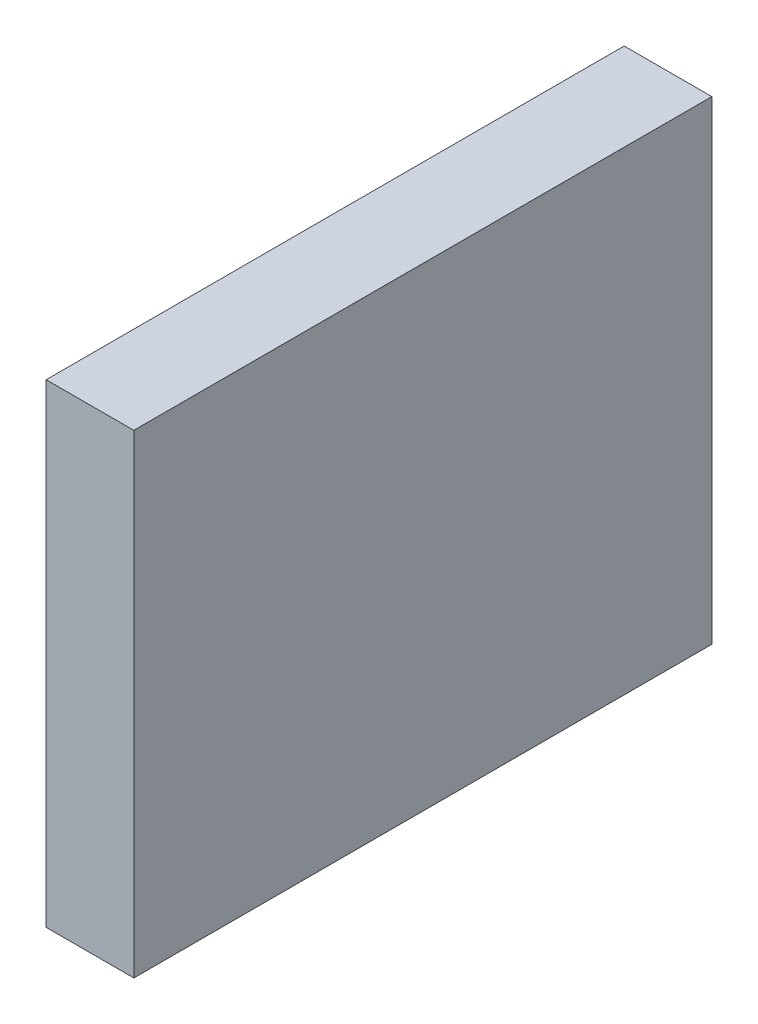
ISO-10303-21;
HEADER;
FILE_DESCRIPTION(('STEP AP214'),'2;1');
FILE_NAME('part.step','',(''),(''),'','','');
FILE_SCHEMA(('AUTOMOTIVE_DESIGN { 1 0 10303 214 1 1 1 1 }'));
ENDSEC;
DATA;
#1=APPLICATION_CONTEXT('core data for automotive mechanical design processes');
#2=APPLICATION_PROTOCOL_DEFINITION('international standard','automotive_design',2000,#1);
#3=PRODUCT_CONTEXT('',#1,'mechanical');
#4=PRODUCT('Part','Part','',(#3));
#5=PRODUCT_RELATED_PRODUCT_CATEGORY('part','',(#4));
#6=PRODUCT_DEFINITION_FORMATION('','',#4);
#7=PRODUCT_DEFINITION_CONTEXT('part definition',#1,'design');
#8=PRODUCT_DEFINITION('design','',#6,#7);
#9=PRODUCT_DEFINITION_SHAPE('','',#8);
#10=(LENGTH_UNIT() NAMED_UNIT(*) SI_UNIT(.MILLI.,.METRE.));
#11=(NAMED_UNIT(*) PLANE_ANGLE_UNIT() SI_UNIT($,.RADIAN.));
#12=(NAMED_UNIT(*) SI_UNIT($,.STERADIAN.) SOLID_ANGLE_UNIT());
#13=UNCERTAINTY_MEASURE_WITH_UNIT(LENGTH_MEASURE(1.E-05),#10,'distance_accuracy_value','');
#14=(GEOMETRIC_REPRESENTATION_CONTEXT(3) GLOBAL_UNCERTAINTY_ASSIGNED_CONTEXT((#13)) GLOBAL_UNIT_ASSIGNED_CONTEXT((#10,
#11,#12)) REPRESENTATION_CONTEXT('',''));
#15=CARTESIAN_POINT('',(0.,0.,0.));
#16=DIRECTION('',(0.,0.,1.));
#17=DIRECTION('',(1.,0.,0.));
#18=AXIS2_PLACEMENT_3D('',#15,#16,#17);
#19=CARTESIAN_POINT('',(0.,0.,102.));
#20=DIRECTION('',(1.,0.,0.));
#21=DIRECTION('',(0.,0.,-1.));
#22=AXIS2_PLACEMENT_3D('',#19,#20,#21);
#23=PLANE('',#22);
#24=DIRECTION('',(0.,-1.,0.));
#25=VECTOR('',#24,1.);
#26=CARTESIAN_POINT('',(0.,0.,0.));
#27=LINE('',#26,#25);
#28=CARTESIAN_POINT('',(0.,83.7000822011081,0.));
#29=VERTEX_POINT('',#28);
#30=CARTESIAN_POINT('',(0.,0.,0.));
#31=VERTEX_POINT('',#30);
#32=EDGE_CURVE('E96',#29,#31,#27,.T.);
#33=ORIENTED_EDGE('',*,*,#32,.T.);
#34=DIRECTION('',(0.,0.,-1.));
#35=VECTOR('',#34,1.);
#36=CARTESIAN_POINT('',(0.,0.,102.));
#37=LINE('',#36,#35);
#38=CARTESIAN_POINT('',(0.,0.,102.));
#39=VERTEX_POINT('',#38);
#40=EDGE_CURVE('E11',#39,#31,#37,.T.);
#41=ORIENTED_EDGE('',*,*,#40,.F.);
#42=DIRECTION('',(0.,-1.,0.));
#43=VECTOR('',#42,1.);
#44=CARTESIAN_POINT('',(0.,0.,102.));
#45=LINE('',#44,#43);
#46=CARTESIAN_POINT('',(0.,83.7000822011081,102.));
#47=VERTEX_POINT('',#46);
#48=EDGE_CURVE('E84',#47,#39,#45,.T.);
#49=ORIENTED_EDGE('',*,*,#48,.F.);
#50=DIRECTION('',(0.,0.,-1.));
#51=VECTOR('',#50,1.);
#52=CARTESIAN_POINT('',(0.,83.7000822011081,102.));
#53=LINE('',#52,#51);
#54=EDGE_CURVE('E92',#47,#29,#53,.T.);
#55=ORIENTED_EDGE('',*,*,#54,.T.);
#56=EDGE_LOOP('',(#33,#41,#49,#55));
#57=FACE_BOUND('',#56,.T.);
#58=ADVANCED_FACE('F33',(#57),#23,.F.);
#59=CARTESIAN_POINT('',(0.,0.,102.));
#60=DIRECTION('',(0.,1.,0.));
#61=DIRECTION('',(0.,0.,1.));
#62=AXIS2_PLACEMENT_3D('',#59,#60,#61);
#63=PLANE('',#62);
#64=DIRECTION('',(1.,0.,0.));
#65=VECTOR('',#64,1.);
#66=CARTESIAN_POINT('',(0.,0.,0.));
#67=LINE('',#66,#65);
#68=CARTESIAN_POINT('',(15.469383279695,0.,0.));
#69=VERTEX_POINT('',#68);
#70=EDGE_CURVE('E88',#31,#69,#67,.T.);
#71=ORIENTED_EDGE('',*,*,#70,.T.);
#72=DIRECTION('',(0.,0.,-1.));
#73=VECTOR('',#72,1.);
#74=CARTESIAN_POINT('',(15.469383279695,0.,102.));
#75=LINE('',#74,#73);
#76=CARTESIAN_POINT('',(15.469383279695,0.,102.));
#77=VERTEX_POINT('',#76);
#78=EDGE_CURVE('E41',#77,#69,#75,.T.);
#79=ORIENTED_EDGE('',*,*,#78,.F.);
#80=DIRECTION('',(1.,0.,0.));
#81=VECTOR('',#80,1.);
#82=CARTESIAN_POINT('',(0.,0.,102.));
#83=LINE('',#82,#81);
#84=EDGE_CURVE('E79',#39,#77,#83,.T.);
#85=ORIENTED_EDGE('',*,*,#84,.F.);
#86=ORIENTED_EDGE('',*,*,#40,.T.);
#87=EDGE_LOOP('',(#71,#79,#85,#86));
#88=FACE_BOUND('',#87,.T.);
#89=ADVANCED_FACE('F87',(#88),#63,.F.);
#90=CARTESIAN_POINT('',(15.469383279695,0.,102.));
#91=DIRECTION('',(-1.,0.,0.));
#92=DIRECTION('',(0.,0.,1.));
#93=AXIS2_PLACEMENT_3D('',#90,#91,#92);
#94=PLANE('',#93);
#95=DIRECTION('',(0.,1.,0.));
#96=VECTOR('',#95,1.);
#97=CARTESIAN_POINT('',(15.469383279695,0.,0.));
#98=LINE('',#97,#96);
#99=CARTESIAN_POINT('',(15.469383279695,83.7000822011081,0.));
#100=VERTEX_POINT('',#99);
#101=EDGE_CURVE('E66',#69,#100,#98,.T.);
#102=ORIENTED_EDGE('',*,*,#101,.T.);
#103=DIRECTION('',(0.,0.,-1.));
#104=VECTOR('',#103,1.);
#105=CARTESIAN_POINT('',(15.469383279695,83.7000822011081,102.));
#106=LINE('',#105,#104);
#107=CARTESIAN_POINT('',(15.469383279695,83.7000822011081,102.));
#108=VERTEX_POINT('',#107);
#109=EDGE_CURVE('E89',#108,#100,#106,.T.);
#110=ORIENTED_EDGE('',*,*,#109,.F.);
#111=DIRECTION('',(0.,1.,0.));
#112=VECTOR('',#111,1.);
#113=CARTESIAN_POINT('',(15.469383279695,0.,102.));
#114=LINE('',#113,#112);
#115=EDGE_CURVE('E82',#77,#108,#114,.T.);
#116=ORIENTED_EDGE('',*,*,#115,.F.);
#117=ORIENTED_EDGE('',*,*,#78,.T.);
#118=EDGE_LOOP('',(#102,#110,#116,#117));
#119=FACE_BOUND('',#118,.T.);
#120=ADVANCED_FACE('F90',(#119),#94,.F.);
#121=CARTESIAN_POINT('',(0.,83.7000822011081,102.));
#122=DIRECTION('',(0.,-1.,0.));
#123=DIRECTION('',(0.,0.,-1.));
#124=AXIS2_PLACEMENT_3D('',#121,#122,#123);
#125=PLANE('',#124);
#126=DIRECTION('',(-1.,0.,0.));
#127=VECTOR('',#126,1.);
#128=CARTESIAN_POINT('',(0.,83.7000822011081,0.));
#129=LINE('',#128,#127);
#130=EDGE_CURVE('E72',#100,#29,#129,.T.);
#131=ORIENTED_EDGE('',*,*,#130,.T.);
#132=ORIENTED_EDGE('',*,*,#54,.F.);
#133=DIRECTION('',(-1.,0.,0.));
#134=VECTOR('',#133,1.);
#135=CARTESIAN_POINT('',(0.,83.7000822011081,102.));
#136=LINE('',#135,#134);
#137=EDGE_CURVE('E49',#108,#47,#136,.T.);
#138=ORIENTED_EDGE('',*,*,#137,.F.);
#139=ORIENTED_EDGE('',*,*,#109,.T.);
#140=EDGE_LOOP('',(#131,#132,#138,#139));
#141=FACE_BOUND('',#140,.T.);
#142=ADVANCED_FACE('F103',(#141),#125,.F.);
#143=CARTESIAN_POINT('',(0.,83.7000822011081,102.));
#144=DIRECTION('',(0.,0.,-1.));
#145=DIRECTION('',(-1.,0.,0.));
#146=AXIS2_PLACEMENT_3D('',#143,#144,#145);
#147=PLANE('',#146);
#148=ORIENTED_EDGE('',*,*,#48,.T.);
#149=ORIENTED_EDGE('',*,*,#84,.T.);
#150=ORIENTED_EDGE('',*,*,#115,.T.);
#151=ORIENTED_EDGE('',*,*,#137,.T.);
#152=EDGE_LOOP('',(#148,#149,#150,#151));
#153=FACE_BOUND('',#152,.T.);
#154=ADVANCED_FACE('F80',(#153),#147,.F.);
#155=CARTESIAN_POINT('',(0.,83.7000822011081,0.));
#156=DIRECTION('',(0.,0.,-1.));
#157=DIRECTION('',(-1.,0.,0.));
#158=AXIS2_PLACEMENT_3D('',#155,#156,#157);
#159=PLANE('',#158);
#160=ORIENTED_EDGE('',*,*,#32,.F.);
#161=ORIENTED_EDGE('',*,*,#130,.F.);
#162=ORIENTED_EDGE('',*,*,#101,.F.);
#163=ORIENTED_EDGE('',*,*,#70,.F.);
#164=EDGE_LOOP('',(#160,#161,#162,#163));
#165=FACE_BOUND('',#164,.T.);
#166=ADVANCED_FACE('F106',(#165),#159,.T.);
#167=CLOSED_SHELL('',(#58,#89,#120,#142,#154,#166));
#168=MANIFOLD_SOLID_BREP('B2',#167);
#169=ADVANCED_BREP_SHAPE_REPRESENTATION('',(#18,#168),#14);
#170=SHAPE_DEFINITION_REPRESENTATION(#9,#169);
ENDSEC;
END-ISO-10303-21;
